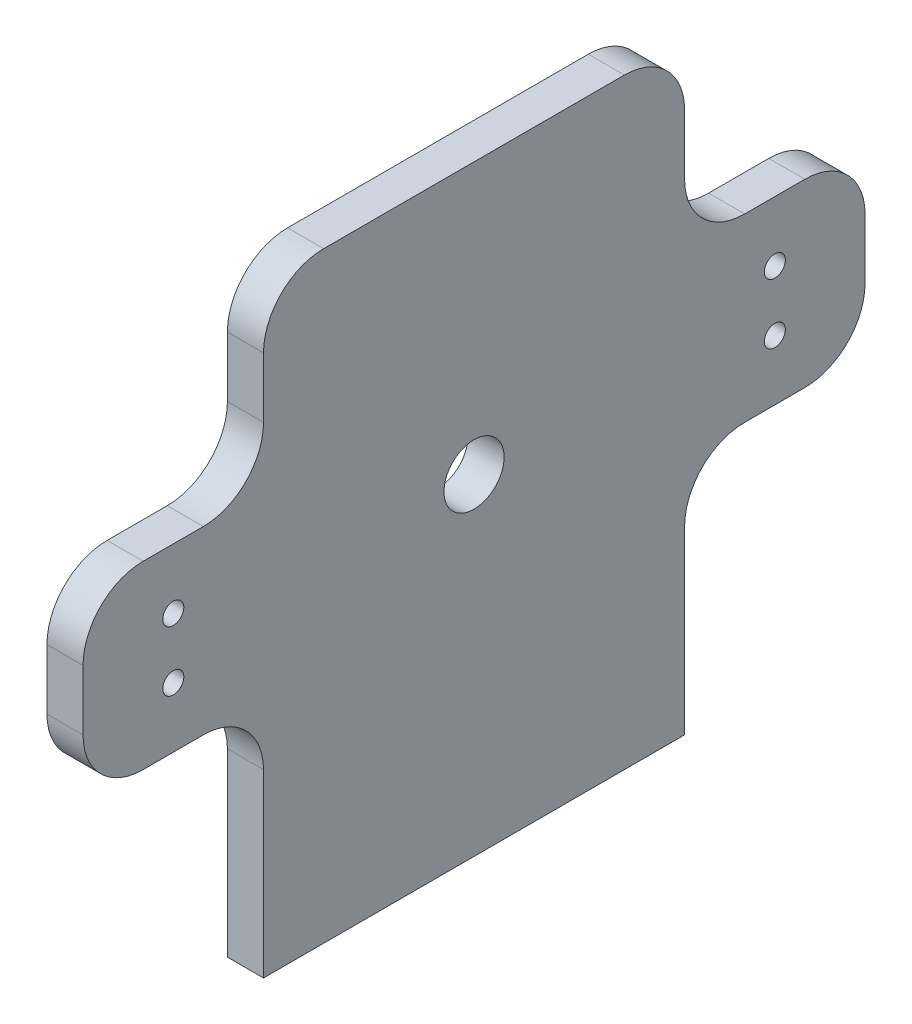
from build123d import *

# Parameters (mm, degrees)
EXTRUDE1_DEPTH              = 6
M3_TAPPED_HOLE1_D           = 2.5
M3_TAPPED_HOLE1_DEPTH       = 10
M3_TAPPED_HOLE1_CBORE_D     = 3
M3_TAPPED_HOLE1_CBORE_DEPTH = 6
M3_TAPPED_HOLE1_TIP         = 0.751075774
SKETCH4_R                   = 5
EXTRUDE2_DEPTH              = 142.548578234
SKETCH5_R                   = 1.75
EXTRUDE3_DEPTH              = 142.548578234
FILLET1_R                   = 10


with BuildPart() as part:
    # Sketch1 → Extrude1 (new body)
    with BuildSketch(Plane(origin=(0, 0, 0), x_dir=(0, 0, -1), z_dir=(1, 0, 0))):
        Polygon((0, 0), (70, 0), (70, 40), (100, 40), (100, 70), (70, 70), (70, 100), (0, 100), (0, 70), (-30, 70), (-30, 40), (0, 40), align=None)
    extrude(amount=EXTRUDE1_DEPTH)

    # M3 Tapped Hole1
    with Locations(Plane(origin=(3, 0, -20), x_dir=(0, 0, -1), z_dir=(0, -1, 0))):
        with Locations((0, 0), (30, 0)):
            CounterBoreHole(M3_TAPPED_HOLE1_D / 2, M3_TAPPED_HOLE1_CBORE_D / 2, M3_TAPPED_HOLE1_CBORE_DEPTH, depth=M3_TAPPED_HOLE1_DEPTH)
            with Locations((0, 0, -(M3_TAPPED_HOLE1_DEPTH + M3_TAPPED_HOLE1_TIP / 2))):  # 118° drill point
                Cone(0, M3_TAPPED_HOLE1_D / 2, M3_TAPPED_HOLE1_TIP, mode=Mode.SUBTRACT)

    # Sketch4 → Extrude2 (cut, through all)
    with BuildSketch(Plane(origin=(6, 0, 0), x_dir=(0, 0, -1), z_dir=(1, 0, 0))):
        with Locations((35, 55)):
            Circle(SKETCH4_R)
    extrude(amount=-EXTRUDE2_DEPTH, mode=Mode.SUBTRACT)

    # Sketch5 → Extrude3 (cut, through all)
    with BuildSketch(Plane(origin=(6, 0, 0), x_dir=(0, 0, -1), z_dir=(1, 0, 0))):
        with Locations((85, 60)):
            Circle(SKETCH5_R)
        with Locations((85, 50)):
            Circle(SKETCH5_R)
        with Locations(Location((-15, 50, 0), (0, 0, 180))):
            Circle(SKETCH5_R)
        with Locations(Location((-15, 60, 0), (0, 0, 180))):
            Circle(SKETCH5_R)
    extrude(amount=-EXTRUDE3_DEPTH, mode=Mode.SUBTRACT)

    # Fillet1
    fillet1_edges = [part.edges().sort_by_distance(p)[0] for p in [
        (3, 40, 0),
        (3, 40, 30),
        (3, 70, 30),
        (3, 70, 0),
        (3, 100, 0),
        (3, 100, -70),
        (3, 70, -70),
        (3, 70, -100),
        (3, 40, -100),
        (3, 40, -70),
    ]]
    fillet(fillet1_edges, radius=FILLET1_R)


solid = part.part
